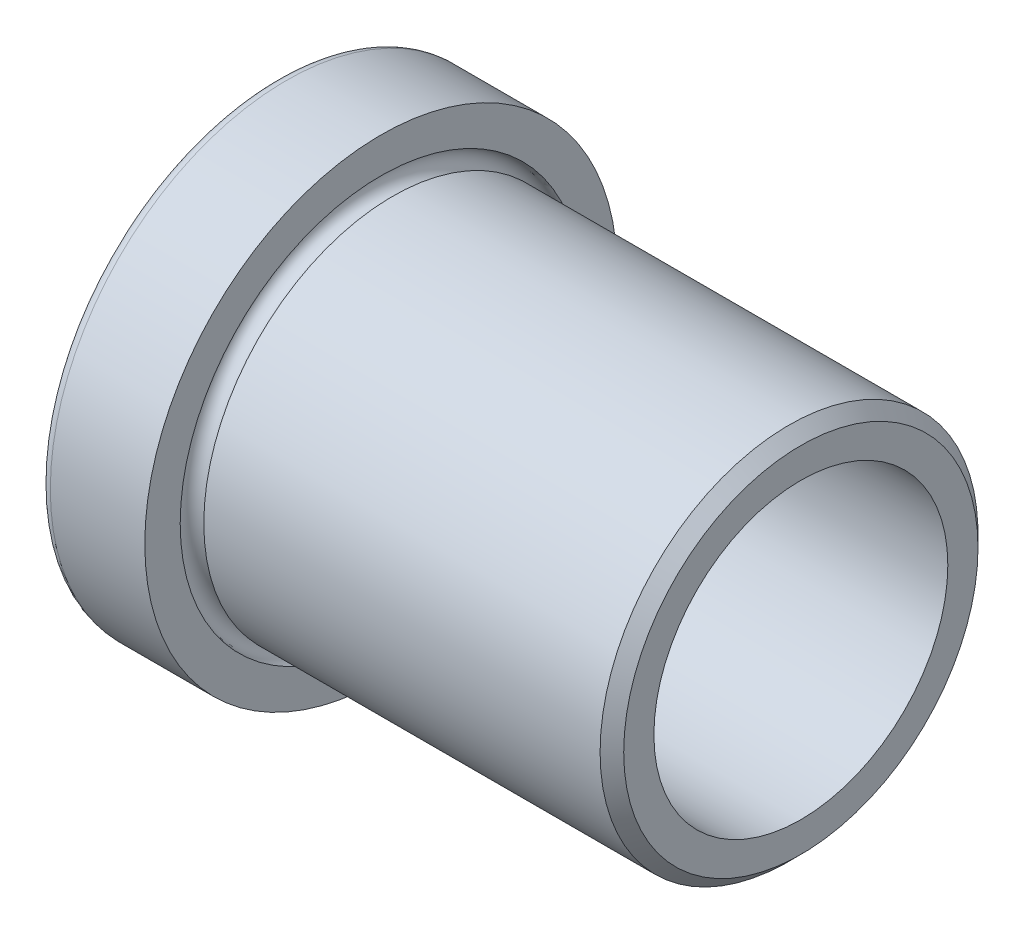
from build123d import *


with BuildPart() as part:
    # Sketch1 → BaseBody (revolve)
    with BuildSketch(Plane.XY, mode=Mode.PRIVATE) as basebody_sk:
        with BuildLine():
            Line((0, 25.4), (0, 34.1249))
            ThreePointArc((0, 34.1249), (0.464967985, 35.247432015), (1.5875, 35.7124))
            Line((1.5875, 35.7124), (15.875, 35.7124))
            Line((15.875, 35.7124), (15.875, 30.35935))
            ThreePointArc((15.875, 30.35935), (14.613274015, 27.313274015), (17.65935, 28.575))
            Line((17.65935, 28.575), (77.5890625, 28.575))
            Line((77.5890625, 28.575), (79.375, 26.7890625))
            Line((79.375, 26.7890625), (79.375, 22.225))
            Line((79.375, 22.225), (3.175, 22.225))
            ThreePointArc((3.175, 22.225), (0.92993597, 23.15493597), (0, 25.4))
        make_face()
    revolve(basebody_sk.sketch.rotate(Axis((0, 0, 0), (1, 0, 0)), 90), axis=Axis((0, 0, 0), (1, 0, 0)))


solid = part.part
